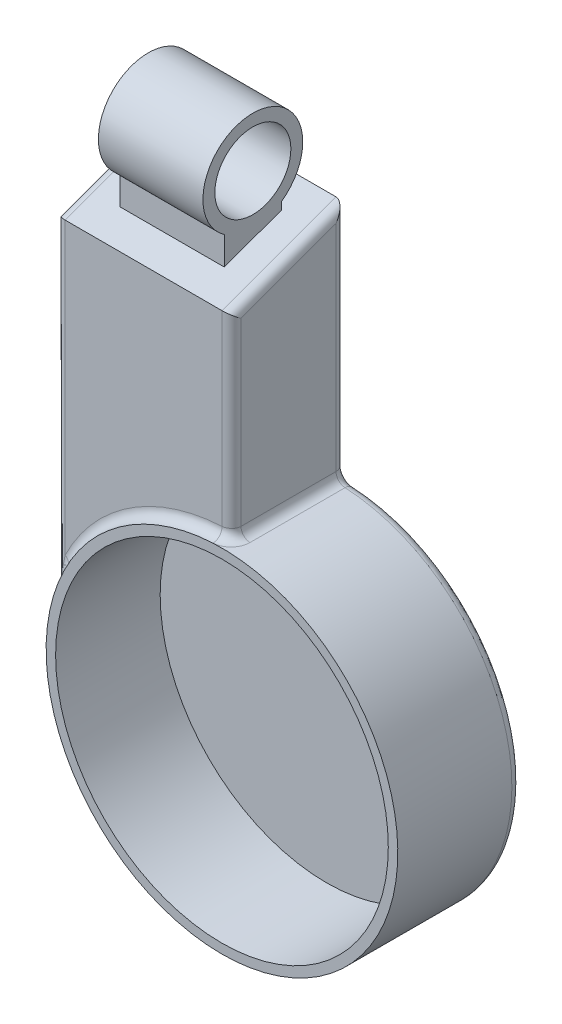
ISO-10303-21;
HEADER;
FILE_DESCRIPTION(('STEP AP214'),'2;1');
FILE_NAME('part.step','',(''),(''),'','','');
FILE_SCHEMA(('AUTOMOTIVE_DESIGN { 1 0 10303 214 1 1 1 1 }'));
ENDSEC;
DATA;
#1=APPLICATION_CONTEXT('core data for automotive mechanical design processes');
#2=APPLICATION_PROTOCOL_DEFINITION('international standard','automotive_design',2000,#1);
#3=PRODUCT_CONTEXT('',#1,'mechanical');
#4=PRODUCT('Part','Part','',(#3));
#5=PRODUCT_RELATED_PRODUCT_CATEGORY('part','',(#4));
#6=PRODUCT_DEFINITION_FORMATION('','',#4);
#7=PRODUCT_DEFINITION_CONTEXT('part definition',#1,'design');
#8=PRODUCT_DEFINITION('design','',#6,#7);
#9=PRODUCT_DEFINITION_SHAPE('','',#8);
#10=(LENGTH_UNIT() NAMED_UNIT(*) SI_UNIT(.MILLI.,.METRE.));
#11=(NAMED_UNIT(*) PLANE_ANGLE_UNIT() SI_UNIT($,.RADIAN.));
#12=(NAMED_UNIT(*) SI_UNIT($,.STERADIAN.) SOLID_ANGLE_UNIT());
#13=UNCERTAINTY_MEASURE_WITH_UNIT(LENGTH_MEASURE(1.E-05),#10,'distance_accuracy_value','');
#14=(GEOMETRIC_REPRESENTATION_CONTEXT(3) GLOBAL_UNCERTAINTY_ASSIGNED_CONTEXT((#13)) GLOBAL_UNIT_ASSIGNED_CONTEXT((#10,
#11,#12)) REPRESENTATION_CONTEXT('',''));
#15=CARTESIAN_POINT('',(0.,0.,0.));
#16=DIRECTION('',(0.,0.,1.));
#17=DIRECTION('',(1.,0.,0.));
#18=AXIS2_PLACEMENT_3D('',#15,#16,#17);
#19=CARTESIAN_POINT('',(-14.75,48.,3.));
#20=DIRECTION('',(0.,0.,1.));
#21=DIRECTION('',(1.,0.,0.));
#22=AXIS2_PLACEMENT_3D('',#19,#20,#21);
#23=PLANE('',#22);
#24=DIRECTION('',(-1.,0.,0.));
#25=VECTOR('',#24,1.);
#26=CARTESIAN_POINT('',(-3.75,43.1915780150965,3.));
#27=LINE('',#26,#25);
#28=CARTESIAN_POINT('',(-3.75,43.1915780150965,3.));
#29=VERTEX_POINT('',#28);
#30=CARTESIAN_POINT('',(-14.75,43.1915780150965,3.));
#31=VERTEX_POINT('',#30);
#32=EDGE_CURVE('E154',#29,#31,#27,.T.);
#33=ORIENTED_EDGE('',*,*,#32,.F.);
#34=DIRECTION('',(0.,-1.,0.));
#35=VECTOR('',#34,1.);
#36=CARTESIAN_POINT('',(-3.75,48.,3.));
#37=LINE('',#36,#35);
#38=CARTESIAN_POINT('',(-3.75,42.4080892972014,3.));
#39=VERTEX_POINT('',#38);
#40=EDGE_CURVE('E50',#29,#39,#37,.T.);
#41=ORIENTED_EDGE('',*,*,#40,.T.);
#42=DIRECTION('',(-1.,0.,0.));
#43=VECTOR('',#42,1.);
#44=CARTESIAN_POINT('',(18.5,42.4080892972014,3.));
#45=LINE('',#44,#43);
#46=CARTESIAN_POINT('',(-14.75,42.4080892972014,3.));
#47=VERTEX_POINT('',#46);
#48=EDGE_CURVE('E570',#39,#47,#45,.T.);
#49=ORIENTED_EDGE('',*,*,#48,.T.);
#50=DIRECTION('',(0.,-1.,0.));
#51=VECTOR('',#50,1.);
#52=CARTESIAN_POINT('',(-14.75,48.,3.));
#53=LINE('',#52,#51);
#54=EDGE_CURVE('E58',#31,#47,#53,.T.);
#55=ORIENTED_EDGE('',*,*,#54,.F.);
#56=EDGE_LOOP('',(#33,#41,#49,#55));
#57=FACE_BOUND('',#56,.T.);
#58=ADVANCED_FACE('F35',(#57),#23,.F.);
#59=CARTESIAN_POINT('',(-14.75,48.,9.));
#60=DIRECTION('',(0.,0.,-1.));
#61=DIRECTION('',(-1.,0.,0.));
#62=AXIS2_PLACEMENT_3D('',#59,#60,#61);
#63=PLANE('',#62);
#64=DIRECTION('',(-1.,0.,0.));
#65=VECTOR('',#64,1.);
#66=CARTESIAN_POINT('',(-3.75,43.1915780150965,9.));
#67=LINE('',#66,#65);
#68=CARTESIAN_POINT('',(-14.75,43.1915780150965,9.));
#69=VERTEX_POINT('',#68);
#70=CARTESIAN_POINT('',(-3.75,43.1915780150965,9.));
#71=VERTEX_POINT('',#70);
#72=EDGE_CURVE('E11',#69,#71,#67,.F.);
#73=ORIENTED_EDGE('',*,*,#72,.F.);
#74=DIRECTION('',(0.,-1.,0.));
#75=VECTOR('',#74,1.);
#76=CARTESIAN_POINT('',(-14.75,48.,9.));
#77=LINE('',#76,#75);
#78=CARTESIAN_POINT('',(-14.75,40.2242678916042,9.));
#79=VERTEX_POINT('',#78);
#80=EDGE_CURVE('E160',#69,#79,#77,.T.);
#81=ORIENTED_EDGE('',*,*,#80,.T.);
#82=DIRECTION('',(1.,0.,0.));
#83=VECTOR('',#82,1.);
#84=CARTESIAN_POINT('',(18.5,40.2242678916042,9.));
#85=LINE('',#84,#83);
#86=CARTESIAN_POINT('',(-3.75,40.2242678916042,9.));
#87=VERTEX_POINT('',#86);
#88=EDGE_CURVE('E159',#79,#87,#85,.T.);
#89=ORIENTED_EDGE('',*,*,#88,.T.);
#90=DIRECTION('',(0.,-1.,0.));
#91=VECTOR('',#90,1.);
#92=CARTESIAN_POINT('',(-3.75,48.,9.));
#93=LINE('',#92,#91);
#94=EDGE_CURVE('E152',#71,#87,#93,.T.);
#95=ORIENTED_EDGE('',*,*,#94,.F.);
#96=EDGE_LOOP('',(#73,#81,#89,#95));
#97=FACE_BOUND('',#96,.T.);
#98=ADVANCED_FACE('F157',(#97),#63,.F.);
#99=CARTESIAN_POINT('',(18.5,43.5,0.));
#100=DIRECTION('',(0.,-0.939692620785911,-0.342020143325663));
#101=DIRECTION('',(0.,0.342020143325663,-0.939692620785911));
#102=AXIS2_PLACEMENT_3D('',#99,#100,#101);
#103=PLANE('',#102);
#104=DIRECTION('',(-1.,0.,0.));
#105=VECTOR('',#104,1.);
#106=CARTESIAN_POINT('',(18.5,39.1323571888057,12.));
#107=LINE('',#106,#105);
#108=CARTESIAN_POINT('',(-1.,39.1323571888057,12.));
#109=VERTEX_POINT('',#108);
#110=CARTESIAN_POINT('',(-17.5,39.1323571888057,12.));
#111=VERTEX_POINT('',#110);
#112=EDGE_CURVE('E169',#109,#111,#107,.T.);
#113=ORIENTED_EDGE('',*,*,#112,.F.);
#114=DIRECTION('',(0.,-0.342020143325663,0.939692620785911));
#115=VECTOR('',#114,1.);
#116=CARTESIAN_POINT('',(-1.,43.5,0.));
#117=LINE('',#116,#115);
#118=CARTESIAN_POINT('',(-1.,43.5,0.));
#119=VERTEX_POINT('',#118);
#120=EDGE_CURVE('E588',#109,#119,#117,.F.);
#121=ORIENTED_EDGE('',*,*,#120,.T.);
#122=DIRECTION('',(-1.,0.,0.));
#123=VECTOR('',#122,1.);
#124=CARTESIAN_POINT('',(-18.5,43.5,0.));
#125=LINE('',#124,#123);
#126=CARTESIAN_POINT('',(-17.5,43.5,0.));
#127=VERTEX_POINT('',#126);
#128=EDGE_CURVE('E174',#119,#127,#125,.T.);
#129=ORIENTED_EDGE('',*,*,#128,.T.);
#130=DIRECTION('',(0.,-0.342020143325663,0.939692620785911));
#131=VECTOR('',#130,1.);
#132=CARTESIAN_POINT('',(-17.5,43.5,0.));
#133=LINE('',#132,#131);
#134=EDGE_CURVE('E609',#127,#111,#133,.T.);
#135=ORIENTED_EDGE('',*,*,#134,.T.);
#136=EDGE_LOOP('',(#113,#121,#129,#135));
#137=FACE_BOUND('',#136,.T.);
#138=DIRECTION('',(0.,0.342020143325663,-0.939692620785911));
#139=VECTOR('',#138,1.);
#140=CARTESIAN_POINT('',(-3.75,43.5,0.));
#141=LINE('',#140,#139);
#142=EDGE_CURVE('E43',#87,#39,#141,.T.);
#143=ORIENTED_EDGE('',*,*,#142,.F.);
#144=ORIENTED_EDGE('',*,*,#88,.F.);
#145=DIRECTION('',(0.,-0.342020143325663,0.939692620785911));
#146=VECTOR('',#145,1.);
#147=CARTESIAN_POINT('',(-14.75,43.5,0.));
#148=LINE('',#147,#146);
#149=EDGE_CURVE('E568',#47,#79,#148,.T.);
#150=ORIENTED_EDGE('',*,*,#149,.F.);
#151=ORIENTED_EDGE('',*,*,#48,.F.);
#152=EDGE_LOOP('',(#143,#144,#150,#151));
#153=FACE_BOUND('',#152,.T.);
#154=ADVANCED_FACE('F208',(#137,#153),#103,.F.);
#155=CARTESIAN_POINT('',(0.,0.,13.));
#156=DIRECTION('',(0.,0.,-1.));
#157=DIRECTION('',(-1.,0.,0.));
#158=AXIS2_PLACEMENT_3D('',#155,#156,#157);
#159=CYLINDRICAL_SURFACE('',#158,18.5);
#160=CARTESIAN_POINT('',(0.,0.,13.));
#161=DIRECTION('',(0.,0.,1.));
#162=DIRECTION('',(1.,0.,0.));
#163=AXIS2_PLACEMENT_3D('',#160,#161,#162);
#164=CIRCLE('',#163,18.5);
#165=CARTESIAN_POINT('',(-16.602564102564,8.16118038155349,13.));
#166=VERTEX_POINT('',#165);
#167=CARTESIAN_POINT('',(-0.948717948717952,18.475657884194,13.));
#168=VERTEX_POINT('',#167);
#169=EDGE_CURVE('E177',#166,#168,#164,.T.);
#170=ORIENTED_EDGE('',*,*,#169,.F.);
#171=CARTESIAN_POINT('',(-15.6779646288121,9.82096864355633,12.746481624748));
#172=CARTESIAN_POINT('',(-15.9118922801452,9.44753201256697,11.2589580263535));
#173=CARTESIAN_POINT('',(-17.0127110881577,10.3518318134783,11.873240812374));
#174=CARTESIAN_POINT('',(-15.7190255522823,9.75542321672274,12.7706205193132));
#175=CARTESIAN_POINT('',(-15.9322694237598,9.41158945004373,11.3056108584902));
#176=CARTESIAN_POINT('',(-17.0343513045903,10.2827433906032,11.8853102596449));
#177=CARTESIAN_POINT('',(-15.7599766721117,9.68913260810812,12.7926121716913));
#178=CARTESIAN_POINT('',(-15.9549811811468,9.37175366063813,11.3508656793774));
#179=CARTESIAN_POINT('',(-17.0559336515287,10.2128695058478,11.8963060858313));
#180=CARTESIAN_POINT('',(-15.841479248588,9.55529473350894,12.8326729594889));
#181=CARTESIAN_POINT('',(-16.0035852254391,9.28633553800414,11.4368688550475));
#182=CARTESIAN_POINT('',(-17.0988877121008,10.0717971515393,11.9163364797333));
#183=CARTESIAN_POINT('',(-15.8820308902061,9.48774809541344,12.8507440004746));
#184=CARTESIAN_POINT('',(-16.0294128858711,9.24087101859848,11.4777763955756));
#185=CARTESIAN_POINT('',(-17.1202595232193,10.0005993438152,11.925372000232));
#186=CARTESIAN_POINT('',(-16.0026712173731,9.2838247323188,12.8995822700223));
#187=CARTESIAN_POINT('',(-16.1092280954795,9.09939203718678,11.5921727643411));
#188=CARTESIAN_POINT('',(-17.183840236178,9.78565309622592,11.9497911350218));
#189=CARTESIAN_POINT('',(-16.0819562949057,9.14582828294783,12.9250937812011));
#190=CARTESIAN_POINT('',(-16.1674772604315,8.99496891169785,11.6612874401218));
#191=CARTESIAN_POINT('',(-17.2256256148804,9.64019737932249,11.9625468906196));
#192=CARTESIAN_POINT('',(-16.2367626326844,8.86806659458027,12.9642558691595));
#193=CARTESIAN_POINT('',(-16.2877410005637,8.77414273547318,11.7822838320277));
#194=CARTESIAN_POINT('',(-17.3072127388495,9.34742154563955,11.9821279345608));
#195=CARTESIAN_POINT('',(-16.3123123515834,8.72833033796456,12.9780161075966));
#196=CARTESIAN_POINT('',(-16.3496983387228,8.65809995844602,11.8351668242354));
#197=CARTESIAN_POINT('',(-17.3470294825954,9.20013197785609,11.9890080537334));
#198=CARTESIAN_POINT('',(-16.460048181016,8.44642978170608,12.9958884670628));
#199=CARTESIAN_POINT('',(-16.4749568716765,8.41691412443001,11.9267989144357));
#200=CARTESIAN_POINT('',(-17.4248902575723,8.90299355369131,11.9979442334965));
#201=CARTESIAN_POINT('',(-16.53223143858,8.30426355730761,12.9999925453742));
#202=CARTESIAN_POINT('',(-16.5383868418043,8.29175575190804,11.9661822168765));
#203=CARTESIAN_POINT('',(-17.4629327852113,8.75314266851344,11.9999962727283));
#204=CARTESIAN_POINT('',(-16.7331292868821,7.89556153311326,13.0000138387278));
#205=CARTESIAN_POINT('',(-16.7162114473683,7.92995293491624,12.0598857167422));
#206=CARTESIAN_POINT('',(-17.5688113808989,8.32234864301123,12.0000069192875));
#207=CARTESIAN_POINT('',(-16.8573169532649,7.6267826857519,12.9859098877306));
#208=CARTESIAN_POINT('',(-16.8332652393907,7.67955090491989,12.1028410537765));
#209=CARTESIAN_POINT('',(-17.6342616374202,8.03904120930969,11.9929549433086));
#210=CARTESIAN_POINT('',(-17.0920531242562,7.08512648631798,12.9364114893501));
#211=CARTESIAN_POINT('',(-17.0580254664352,7.16625117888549,12.1560976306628));
#212=CARTESIAN_POINT('',(-17.7579739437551,7.46810629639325,11.9682057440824));
#213=CARTESIAN_POINT('',(-17.2025950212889,6.81224721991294,12.9010067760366));
#214=CARTESIAN_POINT('',(-17.1669583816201,6.9021259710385,12.16810471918));
#215=CARTESIAN_POINT('',(-17.8162325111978,7.18047679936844,11.9505033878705));
#216=CARTESIAN_POINT('',(-17.4105593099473,6.2617556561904,12.8134705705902));
#217=CARTESIAN_POINT('',(-17.3733298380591,6.36461315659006,12.1676857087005));
#218=CARTESIAN_POINT('',(-17.9258353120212,6.60022893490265,11.9067352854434));
#219=CARTESIAN_POINT('',(-17.5078850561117,5.98412363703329,12.7612243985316));
#220=CARTESIAN_POINT('',(-17.4718104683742,6.08975366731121,12.1560325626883));
#221=CARTESIAN_POINT('',(-17.9771286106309,6.30758977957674,11.8806121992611));
#222=CARTESIAN_POINT('',(-17.6885463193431,5.42688939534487,12.6438374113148));
#223=CARTESIAN_POINT('',(-17.6551120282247,5.53547719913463,12.1140405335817));
#224=CARTESIAN_POINT('',(-18.0723419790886,5.7202347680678,11.8219187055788));
#225=CARTESIAN_POINT('',(-17.771884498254,5.14728755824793,12.5786990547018));
#226=CARTESIAN_POINT('',(-17.7408483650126,5.25472075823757,12.0841714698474));
#227=CARTESIAN_POINT('',(-18.1162634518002,5.42551931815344,11.7893495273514));
#228=CARTESIAN_POINT('',(-17.9284974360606,4.57294540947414,12.4350081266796));
#229=CARTESIAN_POINT('',(-17.9019027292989,4.67699795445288,12.008582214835));
#230=CARTESIAN_POINT('',(-18.1988027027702,4.82013164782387,11.7175040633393));
#231=CARTESIAN_POINT('',(-18.0010849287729,4.27813066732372,12.3559569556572));
#232=CARTESIAN_POINT('',(-17.9774369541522,4.37807963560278,11.9623051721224));
#233=CARTESIAN_POINT('',(-18.2370582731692,4.50938097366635,11.6779784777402));
#234=CARTESIAN_POINT('',(-18.1313256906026,3.68735129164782,12.1895496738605));
#235=CARTESIAN_POINT('',(-18.1127935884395,3.77858654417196,11.858352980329));
#236=CARTESIAN_POINT('',(-18.3056986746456,3.88666757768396,11.5947748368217));
#237=CARTESIAN_POINT('',(-18.1889775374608,3.39138655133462,12.1021927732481));
#238=CARTESIAN_POINT('',(-18.1732629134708,3.47658418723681,11.8006544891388));
#239=CARTESIAN_POINT('',(-18.3360827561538,3.57470474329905,11.5510963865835));
#240=CARTESIAN_POINT('',(-18.3395641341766,2.50394295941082,11.8315768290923));
#241=CARTESIAN_POINT('',(-18.3294403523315,2.57804759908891,11.6171096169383));
#242=CARTESIAN_POINT('',(-18.4154459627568,2.63929122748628,11.4157884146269));
#243=CARTESIAN_POINT('',(-18.4106379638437,1.91103625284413,11.6392734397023));
#244=CARTESIAN_POINT('',(-18.4055479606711,1.96534498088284,11.4767463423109));
#245=CARTESIAN_POINT('',(-18.4529037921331,2.01433550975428,11.3196367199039));
#246=CARTESIAN_POINT('',(-18.4683806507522,1.10251039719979,11.3709047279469));
#247=CARTESIAN_POINT('',(-18.4666714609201,1.1325491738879,11.277528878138));
#248=CARTESIAN_POINT('',(-18.4833357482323,1.1621055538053,11.1854523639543));
#249=CARTESIAN_POINT('',(-18.4799764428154,0.887109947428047,11.298815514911));
#250=CARTESIAN_POINT('',(-18.4788959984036,0.911209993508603,11.223779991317));
#251=CARTESIAN_POINT('',(-18.4894470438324,0.935061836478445,11.149407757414));
#252=CARTESIAN_POINT('',(-18.4956302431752,0.456210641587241,11.1539911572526));
#253=CARTESIAN_POINT('',(-18.4953775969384,0.468791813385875,11.1155460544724));
#254=CARTESIAN_POINT('',(-18.4976970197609,0.480870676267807,11.0769955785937));
#255=CARTESIAN_POINT('',(-18.4996888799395,0.240711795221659,11.0812560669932));
#256=CARTESIAN_POINT('',(-18.499671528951,0.247226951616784,11.0609440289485));
#257=CARTESIAN_POINT('',(-18.4998360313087,0.253723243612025,11.0406280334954));
#258=CARTESIAN_POINT('',(-18.4999942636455,0.0168224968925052,11.0056787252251));
#259=CARTESIAN_POINT('',(-18.4999939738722,0.0172771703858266,11.004259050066));
#260=CARTESIAN_POINT('',(-18.4999969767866,0.0177318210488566,11.0028393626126));
#261=CARTESIAN_POINT('',(-18.5000000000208,0.00841123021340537,11.0028393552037));
#262=CARTESIAN_POINT('',(-18.5000000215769,0.00863855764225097,11.0021295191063));
#263=CARTESIAN_POINT('',(-18.5000000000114,0.00886589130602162,11.0014196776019));
#264=CARTESIAN_POINT('',(-18.5,0.,11.));
#265=CARTESIAN_POINT('',(-18.5,0.,11.));
#266=CARTESIAN_POINT('',(-18.5,0.,11.));
#267=(BOUNDED_SURFACE() B_SPLINE_SURFACE(3,2,((#171,#172,#173),(#174,#175,#176),(#177,#178,
#179),(#180,#181,#182),(#183,#184,#185),(#186,#187,#188),(#189,#190,#191),(#192,#193,#194),
(#195,#196,#197),(#198,#199,#200),(#201,#202,#203),(#204,#205,#206),(#207,#208,#209),(#210,#211,
#212),(#213,#214,#215),(#216,#217,#218),(#219,#220,#221),(#222,#223,#224),(#225,#226,#227),
(#228,#229,#230),(#231,#232,#233),(#234,#235,#236),(#237,#238,#239),(#240,#241,#242),(#243,#244,
#245),(#246,#247,#248),(#249,#250,#251),(#252,#253,#254),(#255,#256,#257),(#258,#259,#260),
(#261,#262,#263),(#264,#265,#266)),.UNSPECIFIED.,.F.,.F.,.F.) B_SPLINE_SURFACE_WITH_KNOTS((4,2,
2,2,2,2,2,2,2,2,2,2,2,2,2,4),(3,3),(0.,0.254993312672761,0.509862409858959,1.01830042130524,
1.52194021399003,2.02599934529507,2.96173204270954,3.89791607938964,4.8406146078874,
5.78313353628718,6.77152852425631,7.76001759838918,9.73069120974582,10.4462140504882,
11.1616772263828,11.1896057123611),(0.,1.),
.UNSPECIFIED.) GEOMETRIC_REPRESENTATION_ITEM() RATIONAL_B_SPLINE_SURFACE(((1.,0.54177639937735,
1.),(1.,0.549739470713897,1.),(1.,0.557572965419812,1.),(1.,0.572974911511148,1.),(1.,
0.580543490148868,1.),(1.,0.602816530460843,1.),(1.,0.617128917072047,1.),(1.,0.644593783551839,
1.),(1.,0.657755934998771,1.),(1.,0.683131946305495,1.),(1.,0.695345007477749,1.),(1.,
0.72894127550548,1.),(1.,0.749220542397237,1.),(1.,0.786974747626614,1.),(1.,0.804448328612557,
1.),(1.,0.836952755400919,1.),(1.,0.851965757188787,1.),(1.,0.879598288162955,1.),(1.,
0.892218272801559,1.),(1.,0.915784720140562,1.),(1.,0.926619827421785,1.),(1.,0.945967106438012,
1.),(1.,0.954479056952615,1.),(1.,0.976643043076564,1.),(1.,0.98699866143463,1.),(1.,
0.995403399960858,1.),(1.,0.997089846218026,1.),(1.,0.999365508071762,1.),(1.,0.999954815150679,
1.),(1.,0.999999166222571,1.),(1.,0.999999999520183,1.),(1.,1.,1.))) REPRESENTATION_ITEM('') SURFACE());
#268=CARTESIAN_POINT('',(-15.6779646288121,9.82096864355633,12.746481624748));
#269=CARTESIAN_POINT('',(-15.7190255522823,9.75542321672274,12.7706205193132));
#270=CARTESIAN_POINT('',(-15.7599766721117,9.68913260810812,12.7926121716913));
#271=CARTESIAN_POINT('',(-15.841479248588,9.55529473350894,12.8326729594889));
#272=CARTESIAN_POINT('',(-15.8820308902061,9.48774809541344,12.8507440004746));
#273=CARTESIAN_POINT('',(-16.0026712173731,9.2838247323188,12.8995822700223));
#274=CARTESIAN_POINT('',(-16.0819562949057,9.14582828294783,12.9250937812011));
#275=CARTESIAN_POINT('',(-16.2367626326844,8.86806659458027,12.9642558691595));
#276=CARTESIAN_POINT('',(-16.3123123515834,8.72833033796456,12.9780161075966));
#277=CARTESIAN_POINT('',(-16.460048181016,8.44642978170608,12.9958884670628));
#278=CARTESIAN_POINT('',(-16.53223143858,8.30426355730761,12.9999925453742));
#279=CARTESIAN_POINT('',(-16.7331292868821,7.89556153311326,13.0000138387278));
#280=CARTESIAN_POINT('',(-16.8573169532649,7.6267826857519,12.9859098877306));
#281=CARTESIAN_POINT('',(-17.0920531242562,7.08512648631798,12.9364114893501));
#282=CARTESIAN_POINT('',(-17.2025950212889,6.81224721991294,12.9010067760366));
#283=CARTESIAN_POINT('',(-17.4105593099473,6.2617556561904,12.8134705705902));
#284=CARTESIAN_POINT('',(-17.5078850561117,5.98412363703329,12.7612243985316));
#285=CARTESIAN_POINT('',(-17.6885463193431,5.42688939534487,12.6438374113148));
#286=CARTESIAN_POINT('',(-17.771884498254,5.14728755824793,12.5786990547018));
#287=CARTESIAN_POINT('',(-17.9284974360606,4.57294540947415,12.4350081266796));
#288=CARTESIAN_POINT('',(-18.0010849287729,4.27813066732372,12.3559569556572));
#289=CARTESIAN_POINT('',(-18.1313256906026,3.68735129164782,12.1895496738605));
#290=CARTESIAN_POINT('',(-18.1889775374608,3.39138655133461,12.1021927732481));
#291=CARTESIAN_POINT('',(-18.3395641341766,2.50394295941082,11.8315768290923));
#292=CARTESIAN_POINT('',(-18.4106379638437,1.91103625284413,11.6392734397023));
#293=CARTESIAN_POINT('',(-18.4683806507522,1.10251039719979,11.3709047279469));
#294=CARTESIAN_POINT('',(-18.4799764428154,0.887109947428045,11.298815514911));
#295=CARTESIAN_POINT('',(-18.4956302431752,0.456210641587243,11.1539911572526));
#296=CARTESIAN_POINT('',(-18.4996888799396,0.240711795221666,11.0812560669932));
#297=CARTESIAN_POINT('',(-18.4999942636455,0.0168224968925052,11.0056787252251));
#298=CARTESIAN_POINT('',(-18.5000000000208,0.00841123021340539,11.0028393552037));
#299=CARTESIAN_POINT('',(-18.5,0.,11.));
#300=B_SPLINE_CURVE_WITH_KNOTS('',3,(#268,#269,#270,#271,#272,#273,#274,#275,#276,#277,#278,
#279,#280,#281,#282,#283,#284,#285,#286,#287,#288,#289,#290,#291,#292,#293,#294,#295,#296,#297,
#298,#299),.UNSPECIFIED.,.F.,.F.,(4,2,2,2,2,2,2,2,2,2,2,2,2,2,2,4),(0.,0.254993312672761,
0.509862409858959,1.01830042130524,1.52194021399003,2.02599934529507,2.96173204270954,
3.89791607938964,4.8406146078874,5.78313353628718,6.77152852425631,7.76001759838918,
9.73069120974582,10.4462140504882,11.1616772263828,11.1896057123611),.UNSPECIFIED.);
#301=CARTESIAN_POINT('',(-18.5,0.,11.));
#302=VERTEX_POINT('',#301);
#303=EDGE_CURVE('E324',#166,#302,#300,.T.);
#304=ORIENTED_EDGE('',*,*,#303,.T.);
#305=DIRECTION('',(0.,0.,1.));
#306=VECTOR('',#305,1.);
#307=CARTESIAN_POINT('',(-18.5,0.,0.));
#308=LINE('',#307,#306);
#309=CARTESIAN_POINT('',(-18.5,0.,1.));
#310=VERTEX_POINT('',#309);
#311=EDGE_CURVE('E172',#310,#302,#308,.T.);
#312=ORIENTED_EDGE('',*,*,#311,.F.);
#313=CARTESIAN_POINT('',(0.,0.,0.999999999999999));
#314=DIRECTION('',(0.,0.,1.));
#315=DIRECTION('',(1.,0.,0.));
#316=AXIS2_PLACEMENT_3D('',#313,#314,#315);
#317=CIRCLE('',#316,18.5);
#318=CARTESIAN_POINT('',(0.948717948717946,18.475657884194,0.999999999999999));
#319=VERTEX_POINT('',#318);
#320=EDGE_CURVE('E620',#310,#319,#317,.T.);
#321=ORIENTED_EDGE('',*,*,#320,.T.);
#322=DIRECTION('',(0.,0.,-1.));
#323=VECTOR('',#322,1.);
#324=CARTESIAN_POINT('',(0.948717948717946,18.475657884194,13.));
#325=LINE('',#324,#323);
#326=CARTESIAN_POINT('',(0.948717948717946,18.475657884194,11.));
#327=VERTEX_POINT('',#326);
#328=EDGE_CURVE('E198',#319,#327,#325,.F.);
#329=ORIENTED_EDGE('',*,*,#328,.T.);
#330=CARTESIAN_POINT('',(0.84199509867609,18.4808291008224,10.3387041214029));
#331=CARTESIAN_POINT('',(-0.0610167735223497,18.5219707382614,10.6557345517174));
#332=CARTESIAN_POINT('',(-0.0562458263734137,19.479792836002,10.6693520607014));
#333=CARTESIAN_POINT('',(0.877333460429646,18.4791925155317,10.4447310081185));
#334=CARTESIAN_POINT('',(-0.0409950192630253,18.522785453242,10.7100060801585));
#335=CARTESIAN_POINT('',(-0.0376215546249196,19.4780677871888,10.7223655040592));
#336=CARTESIAN_POINT('',(0.904017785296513,18.477900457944,10.5539311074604));
#337=CARTESIAN_POINT('',(-0.0257353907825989,18.5233867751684,10.766686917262));
#338=CARTESIAN_POINT('',(-0.02355819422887,19.4767058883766,10.7769655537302));
#339=CARTESIAN_POINT('',(0.939700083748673,18.4761345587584,10.775421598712));
#340=CARTESIAN_POINT('',(-0.00525954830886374,18.5241805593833,10.8822102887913));
#341=CARTESIAN_POINT('',(-0.00475265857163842,19.4748445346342,10.887710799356));
#342=CARTESIAN_POINT('',(0.948711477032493,18.4756600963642,10.8877095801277));
#343=CARTESIAN_POINT('',(-9.18741426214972E-06,18.524374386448,10.9411218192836));
#344=CARTESIAN_POINT('',(-3.41076663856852E-06,19.4743444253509,10.9438547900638));
#345=CARTESIAN_POINT('',(0.948724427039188,18.4756556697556,11.1124055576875));
#346=CARTESIAN_POINT('',(9.19681343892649E-06,18.5243739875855,11.0589384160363));
#347=CARTESIAN_POINT('',(3.41426388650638E-06,19.4743397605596,11.0562027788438));
#348=CARTESIAN_POINT('',(0.939707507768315,18.4761266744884,11.2248135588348));
#349=CARTESIAN_POINT('',(-0.00523350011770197,18.5241793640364,11.1179265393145));
#350=CARTESIAN_POINT('',(-0.00474874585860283,19.4748362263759,11.1124067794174));
#351=CARTESIAN_POINT('',(0.903917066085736,18.4779130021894,11.4464115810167));
#352=CARTESIAN_POINT('',(-0.0258152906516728,18.5233859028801,11.2334782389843));
#353=CARTESIAN_POINT('',(-0.0236112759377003,19.4767191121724,11.2232057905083));
#354=CARTESIAN_POINT('',(0.877146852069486,18.4792281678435,11.5556021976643));
#355=CARTESIAN_POINT('',(-0.0411797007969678,18.5227860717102,11.2901146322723));
#356=CARTESIAN_POINT('',(-0.0377199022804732,19.4781053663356,11.2778010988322));
#357=CARTESIAN_POINT('',(0.806608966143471,18.4824407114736,11.7676944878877));
#358=CARTESIAN_POINT('',(-0.081036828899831,18.5211478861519,11.3989158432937));
#359=CARTESIAN_POINT('',(-0.074895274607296,19.4814915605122,11.3838472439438));
#360=CARTESIAN_POINT('',(0.762841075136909,18.4843380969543,11.8705960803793));
#361=CARTESIAN_POINT('',(-0.105573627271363,18.5201075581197,11.4511258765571));
#362=CARTESIAN_POINT('',(-0.0979621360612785,19.4834915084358,11.4352980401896));
#363=CARTESIAN_POINT('',(0.659547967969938,18.4883113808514,12.0672054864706));
#364=CARTESIAN_POINT('',(-0.162342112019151,18.5175623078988,11.5494653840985));
#365=CARTESIAN_POINT('',(-0.152400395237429,19.4876795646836,11.5336027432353));
#366=CARTESIAN_POINT('',(0.600021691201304,18.4903872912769,12.1609126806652));
#367=CARTESIAN_POINT('',(-0.194617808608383,18.5160549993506,11.5956040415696));
#368=CARTESIAN_POINT('',(-0.183772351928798,19.489867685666,11.5804563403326));
#369=CARTESIAN_POINT('',(0.466839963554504,18.4942285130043,12.3365486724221));
#370=CARTESIAN_POINT('',(-0.265235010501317,18.5125902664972,11.6807918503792));
#371=CARTESIAN_POINT('',(-0.253962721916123,19.4939165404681,11.6682743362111));
#372=CARTESIAN_POINT('',(0.393173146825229,18.4959935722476,12.4184679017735));
#373=CARTESIAN_POINT('',(-0.30360657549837,18.5106306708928,11.7198114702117));
#374=CARTESIAN_POINT('',(-0.29278712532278,19.4957770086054,11.7092339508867));
#375=CARTESIAN_POINT('',(0.233826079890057,18.4986935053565,12.5681118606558));
#376=CARTESIAN_POINT('',(-0.384774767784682,18.5063399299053,11.7902488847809));
#377=CARTESIAN_POINT('',(-0.376767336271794,19.4986228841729,11.7840559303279));
#378=CARTESIAN_POINT('',(0.148145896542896,18.499628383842,12.6358366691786));
#379=CARTESIAN_POINT('',(-0.427565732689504,18.5040085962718,11.821621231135));
#380=CARTESIAN_POINT('',(-0.421923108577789,19.499608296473,11.8179183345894));
#381=CARTESIAN_POINT('',(-0.0326988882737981,18.5001915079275,12.7550986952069));
#382=CARTESIAN_POINT('',(-0.51618906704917,18.4991091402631,11.8767232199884));
#383=CARTESIAN_POINT('',(-0.517233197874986,19.5002018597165,11.8775493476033));
#384=CARTESIAN_POINT('',(-0.127853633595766,18.4998210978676,12.8066525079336));
#385=CARTESIAN_POINT('',(-0.561977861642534,18.4965433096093,11.9004094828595));
#386=CARTESIAN_POINT('',(-0.56738232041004,19.4998114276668,11.9033262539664));
#387=CARTESIAN_POINT('',(-0.324995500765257,18.4974075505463,12.8921943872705));
#388=CARTESIAN_POINT('',(-0.655722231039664,18.4913206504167,11.9403850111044));
#389=CARTESIAN_POINT('',(-0.671281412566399,19.4972674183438,11.9460971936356));
#390=CARTESIAN_POINT('',(-0.42698205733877,18.4953645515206,12.9261839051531));
#391=CARTESIAN_POINT('',(-0.703606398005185,18.4886678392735,11.9566328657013));
#392=CARTESIAN_POINT('',(-0.725031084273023,19.4951139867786,11.963091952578));
#393=CARTESIAN_POINT('',(-0.634533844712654,18.4894050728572,12.9755662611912));
#394=CARTESIAN_POINT('',(-0.800882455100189,18.4833882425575,11.9818307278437));
#395=CARTESIAN_POINT('',(-0.834416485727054,19.4888323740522,11.9877831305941));
#396=CARTESIAN_POINT('',(-0.740086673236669,18.4854945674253,12.9910178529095));
#397=CARTESIAN_POINT('',(-0.850177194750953,18.4807663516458,11.990782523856));
#398=CARTESIAN_POINT('',(-0.890045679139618,19.4847104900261,11.9955089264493));
#399=CARTESIAN_POINT('',(-0.952101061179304,18.4757892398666,13.0031273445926));
#400=CARTESIAN_POINT('',(-0.950110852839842,18.4755690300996,12.0013260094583));
#401=CARTESIAN_POINT('',(-1.0017829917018,19.4744805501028,12.0015636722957));
#402=CARTESIAN_POINT('',(-1.05856285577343,18.4699939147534,12.9997802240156));
#403=CARTESIAN_POINT('',(-1.00064975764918,18.4729985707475,12.0029219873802));
#404=CARTESIAN_POINT('',(-1.05789123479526,19.4683719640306,11.999890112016));
#405=CARTESIAN_POINT('',(-1.2693659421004,18.4567003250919,12.9743988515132));
#406=CARTESIAN_POINT('',(-1.10268737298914,18.4678517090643,11.9982591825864));
#407=CARTESIAN_POINT('',(-1.16899015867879,19.4543598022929,11.9871994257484));
#408=CARTESIAN_POINT('',(-1.37370683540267,18.4492017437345,12.9523611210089));
#409=CARTESIAN_POINT('',(-1.15409084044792,18.4652799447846,11.9920352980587));
#410=CARTESIAN_POINT('',(-1.22398062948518,19.4464558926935,11.9761805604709));
#411=CARTESIAN_POINT('',(-1.57742756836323,18.4329186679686,12.8903521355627));
#412=CARTESIAN_POINT('',(-1.25691257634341,18.4600507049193,11.971010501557));
#413=CARTESIAN_POINT('',(-1.33134696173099,19.429292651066,11.9451760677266));
#414=CARTESIAN_POINT('',(-1.67680483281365,18.424133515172,12.8503716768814));
#415=CARTESIAN_POINT('',(-1.30825988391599,18.4573972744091,11.9562681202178));
#416=CARTESIAN_POINT('',(-1.38372146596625,19.420032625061,11.92518583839));
#417=CARTESIAN_POINT('',(-1.77223441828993,18.4149174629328,12.8018108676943));
#418=CARTESIAN_POINT('',(-1.3593677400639,18.4546513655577,11.9368673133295));
#419=CARTESIAN_POINT('',(-1.43401543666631,19.4103184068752,11.9009054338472));
#420=(BOUNDED_SURFACE() B_SPLINE_SURFACE(3,2,((#330,#331,#332),(#333,#334,#335),(#336,#337,
#338),(#339,#340,#341),(#342,#343,#344),(#345,#346,#347),(#348,#349,#350),(#351,#352,#353),
(#354,#355,#356),(#357,#358,#359),(#360,#361,#362),(#363,#364,#365),(#366,#367,#368),(#369,#370,
#371),(#372,#373,#374),(#375,#376,#377),(#378,#379,#380),(#381,#382,#383),(#384,#385,#386),
(#387,#388,#389),(#390,#391,#392),(#393,#394,#395),(#396,#397,#398),(#399,#400,#401),(#402,#403,
#404),(#405,#406,#407),(#408,#409,#410),(#411,#412,#413),(#414,#415,#416),(#417,#418,#419)),
.UNSPECIFIED.,.F.,.F.,.F.) B_SPLINE_SURFACE_WITH_KNOTS((4,2,2,2,2,2,2,2,2,2,2,2,2,2,4),(3,3),
(0.,0.336732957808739,0.673210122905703,1.01003229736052,1.3467917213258,1.68355548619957,
2.02034192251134,2.35740020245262,2.69445660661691,3.03116597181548,3.36784751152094,
3.70345913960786,4.03916040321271,4.37492415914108,4.71086034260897),(0.,1.),
.UNSPECIFIED.) GEOMETRIC_REPRESENTATION_ITEM() RATIONAL_B_SPLINE_SURFACE(((1.,0.722133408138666,
1.),(1.,0.723060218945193,1.),(1.,0.723779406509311,1.),(1.,0.724754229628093,1.),(1.,
0.725010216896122,1.),(1.,0.72501188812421,1.),(1.,0.724757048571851,1.),(1.,0.723774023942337,
1.),(1.,0.723045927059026,1.),(1.,0.721214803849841,1.),(1.,0.720111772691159,1.),(1.,
0.717685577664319,1.),(1.,0.716362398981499,1.),(1.,0.713688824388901,1.),(1.,0.712338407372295,
1.),(1.,0.709823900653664,1.),(1.,0.708659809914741,1.),(1.,0.706723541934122,1.),(1.,
0.705950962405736,1.),(1.,0.704964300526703,1.),(1.,0.704750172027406,1.),(1.,0.704987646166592,
1.),(1.,0.705437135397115,1.),(1.,0.707026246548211,1.),(1.,0.708166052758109,1.),(1.,
0.711085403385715,1.),(1.,0.712865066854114,1.),(1.,0.716922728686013,1.),(1.,0.719200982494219,
1.),(1.,0.721656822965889,1.))) REPRESENTATION_ITEM('') SURFACE());
#421=CARTESIAN_POINT('',(-1.77223441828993,18.4149174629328,12.8018108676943));
#422=CARTESIAN_POINT('',(-1.67680483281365,18.424133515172,12.8503716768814));
#423=CARTESIAN_POINT('',(-1.57742756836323,18.4329186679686,12.8903521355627));
#424=CARTESIAN_POINT('',(-1.37370683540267,18.4492017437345,12.9523611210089));
#425=CARTESIAN_POINT('',(-1.2693659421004,18.4567003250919,12.9743988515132));
#426=CARTESIAN_POINT('',(-1.05856285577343,18.4699939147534,12.9997802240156));
#427=CARTESIAN_POINT('',(-0.952101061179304,18.4757892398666,13.0031273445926));
#428=CARTESIAN_POINT('',(-0.740086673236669,18.4854945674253,12.9910178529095));
#429=CARTESIAN_POINT('',(-0.634533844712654,18.4894050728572,12.9755662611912));
#430=CARTESIAN_POINT('',(-0.42698205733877,18.4953645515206,12.9261839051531));
#431=CARTESIAN_POINT('',(-0.324995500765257,18.4974075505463,12.8921943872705));
#432=CARTESIAN_POINT('',(-0.127853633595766,18.4998210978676,12.8066525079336));
#433=CARTESIAN_POINT('',(-0.0326988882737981,18.5001915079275,12.7550986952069));
#434=CARTESIAN_POINT('',(0.148145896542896,18.499628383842,12.6358366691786));
#435=CARTESIAN_POINT('',(0.233826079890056,18.4986935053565,12.5681118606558));
#436=CARTESIAN_POINT('',(0.393173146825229,18.4959935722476,12.4184679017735));
#437=CARTESIAN_POINT('',(0.466839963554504,18.4942285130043,12.3365486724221));
#438=CARTESIAN_POINT('',(0.600021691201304,18.4903872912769,12.1609126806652));
#439=CARTESIAN_POINT('',(0.659547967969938,18.4883113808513,12.0672054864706));
#440=CARTESIAN_POINT('',(0.762841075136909,18.4843380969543,11.8705960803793));
#441=CARTESIAN_POINT('',(0.806608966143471,18.4824407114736,11.7676944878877));
#442=CARTESIAN_POINT('',(0.877146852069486,18.4792281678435,11.5556021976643));
#443=CARTESIAN_POINT('',(0.903917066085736,18.4779130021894,11.4464115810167));
#444=CARTESIAN_POINT('',(0.939707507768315,18.4761266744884,11.2248135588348));
#445=CARTESIAN_POINT('',(0.948724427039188,18.4756556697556,11.1124055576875));
#446=CARTESIAN_POINT('',(0.948711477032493,18.4756600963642,10.8877095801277));
#447=CARTESIAN_POINT('',(0.939700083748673,18.4761345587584,10.775421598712));
#448=CARTESIAN_POINT('',(0.904017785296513,18.477900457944,10.5539311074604));
#449=CARTESIAN_POINT('',(0.877333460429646,18.4791925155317,10.4447310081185));
#450=CARTESIAN_POINT('',(0.84199509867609,18.4808291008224,10.3387041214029));
#451=B_SPLINE_CURVE_WITH_KNOTS('',3,(#421,#422,#423,#424,#425,#426,#427,#428,#429,#430,#431,
#432,#433,#434,#435,#436,#437,#438,#439,#440,#441,#442,#443,#444,#445,#446,#447,#448,#449,#450),
.UNSPECIFIED.,.F.,.F.,(4,2,2,2,2,2,2,2,2,2,2,2,2,2,4),(0.,0.335936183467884,0.671699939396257,
1.00740120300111,1.34301283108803,1.67969437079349,2.01640373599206,2.35346014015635,
2.69051842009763,3.0273048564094,3.36406862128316,3.70082804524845,4.03765021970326,
4.37412738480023,4.71086034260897),.UNSPECIFIED.);
#452=EDGE_CURVE('E190',#168,#327,#451,.T.);
#453=ORIENTED_EDGE('',*,*,#452,.F.);
#454=EDGE_LOOP('',(#170,#304,#312,#321,#329,#453));
#455=FACE_BOUND('',#454,.T.);
#456=ADVANCED_FACE('F203',(#455),#159,.T.);
#457=CARTESIAN_POINT('',(0.,0.,13.));
#458=DIRECTION('',(0.,0.,1.));
#459=DIRECTION('',(1.,0.,0.));
#460=AXIS2_PLACEMENT_3D('',#457,#458,#459);
#461=PLANE('',#460);
#462=CARTESIAN_POINT('',(0.,0.,13.));
#463=DIRECTION('',(0.,0.,1.));
#464=DIRECTION('',(1.,0.,0.));
#465=AXIS2_PLACEMENT_3D('',#462,#463,#464);
#466=CIRCLE('',#465,17.5);
#467=CARTESIAN_POINT('',(17.5,0.,13.));
#468=VERTEX_POINT('',#467);
#469=EDGE_CURVE('E314',#468,#468,#466,.T.);
#470=ORIENTED_EDGE('',*,*,#469,.F.);
#471=EDGE_LOOP('',(#470));
#472=FACE_BOUND('',#471,.T.);
#473=EDGE_CURVE('E180',#168,#166,#164,.T.);
#474=ORIENTED_EDGE('',*,*,#473,.T.);
#475=ORIENTED_EDGE('',*,*,#169,.T.);
#476=EDGE_LOOP('',(#474,#475));
#477=FACE_BOUND('',#476,.T.);
#478=ADVANCED_FACE('F207',(#472,#477),#461,.T.);
#479=CARTESIAN_POINT('',(0.,0.,0.));
#480=DIRECTION('',(0.,0.,1.));
#481=DIRECTION('',(1.,0.,0.));
#482=AXIS2_PLACEMENT_3D('',#479,#480,#481);
#483=PLANE('',#482);
#484=ORIENTED_EDGE('',*,*,#128,.F.);
#485=DIRECTION('',(0.,-1.,0.));
#486=VECTOR('',#485,1.);
#487=CARTESIAN_POINT('',(-1.,0.,0.));
#488=LINE('',#487,#486);
#489=CARTESIAN_POINT('',(-1.,19.4743420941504,0.));
#490=VERTEX_POINT('',#489);
#491=EDGE_CURVE('E595',#119,#490,#488,.T.);
#492=ORIENTED_EDGE('',*,*,#491,.T.);
#493=CARTESIAN_POINT('',(0.999999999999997,19.4743420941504,0.));
#494=DIRECTION('',(0.,0.,1.));
#495=DIRECTION('',(1.,0.,0.));
#496=AXIS2_PLACEMENT_3D('',#493,#494,#495);
#497=CIRCLE('',#496,2.);
#498=CARTESIAN_POINT('',(0.897435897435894,17.4769736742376,0.));
#499=VERTEX_POINT('',#498);
#500=EDGE_CURVE('E598',#499,#490,#497,.F.);
#501=ORIENTED_EDGE('',*,*,#500,.F.);
#502=CARTESIAN_POINT('',(0.,0.,0.));
#503=DIRECTION('',(0.,0.,1.));
#504=DIRECTION('',(1.,0.,0.));
#505=AXIS2_PLACEMENT_3D('',#502,#503,#504);
#506=CIRCLE('',#505,17.5);
#507=CARTESIAN_POINT('',(-17.5,0.,0.));
#508=VERTEX_POINT('',#507);
#509=EDGE_CURVE('E601',#499,#508,#506,.F.);
#510=ORIENTED_EDGE('',*,*,#509,.T.);
#511=DIRECTION('',(0.,-1.,0.));
#512=VECTOR('',#511,1.);
#513=CARTESIAN_POINT('',(-17.5,0.,0.));
#514=LINE('',#513,#512);
#515=EDGE_CURVE('E625',#508,#127,#514,.F.);
#516=ORIENTED_EDGE('',*,*,#515,.T.);
#517=EDGE_LOOP('',(#484,#492,#501,#510,#516));
#518=FACE_BOUND('',#517,.T.);
#519=ADVANCED_FACE('F210',(#518),#483,.F.);
#520=CARTESIAN_POINT('',(0.,43.5,0.));
#521=DIRECTION('',(-1.,0.,0.));
#522=DIRECTION('',(0.,0.,1.));
#523=AXIS2_PLACEMENT_3D('',#520,#521,#522);
#524=PLANE('',#523);
#525=DIRECTION('',(0.,-1.,0.));
#526=VECTOR('',#525,1.);
#527=CARTESIAN_POINT('',(0.,43.5,11.));
#528=LINE('',#527,#526);
#529=CARTESIAN_POINT('',(0.,38.432149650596,11.));
#530=VERTEX_POINT('',#529);
#531=CARTESIAN_POINT('',(0.,19.4743420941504,11.));
#532=VERTEX_POINT('',#531);
#533=EDGE_CURVE('E550',#530,#532,#528,.T.);
#534=ORIENTED_EDGE('',*,*,#533,.T.);
#535=DIRECTION('',(0.,0.,1.));
#536=VECTOR('',#535,1.);
#537=CARTESIAN_POINT('',(0.,19.4743420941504,0.));
#538=LINE('',#537,#536);
#539=CARTESIAN_POINT('',(0.,19.4743420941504,1.));
#540=VERTEX_POINT('',#539);
#541=EDGE_CURVE('E607',#532,#540,#538,.F.);
#542=ORIENTED_EDGE('',*,*,#541,.T.);
#543=DIRECTION('',(0.,-1.,0.));
#544=VECTOR('',#543,1.);
#545=CARTESIAN_POINT('',(0.,43.5,1.));
#546=LINE('',#545,#544);
#547=CARTESIAN_POINT('',(0.,42.0718519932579,1.));
#548=VERTEX_POINT('',#547);
#549=EDGE_CURVE('E593',#540,#548,#546,.F.);
#550=ORIENTED_EDGE('',*,*,#549,.T.);
#551=DIRECTION('',(0.,-0.342020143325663,0.939692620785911));
#552=VECTOR('',#551,1.);
#553=CARTESIAN_POINT('',(0.,42.5603073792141,-0.342020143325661));
#554=LINE('',#553,#552);
#555=EDGE_CURVE('E589',#548,#530,#554,.T.);
#556=ORIENTED_EDGE('',*,*,#555,.T.);
#557=EDGE_LOOP('',(#534,#542,#550,#556));
#558=FACE_BOUND('',#557,.T.);
#559=ADVANCED_FACE('F301',(#558),#524,.F.);
#560=CARTESIAN_POINT('',(-18.5,43.5,0.));
#561=DIRECTION('',(1.,0.,0.));
#562=DIRECTION('',(0.,0.,-1.));
#563=AXIS2_PLACEMENT_3D('',#560,#561,#562);
#564=PLANE('',#563);
#565=DIRECTION('',(0.,-0.342020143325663,0.939692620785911));
#566=VECTOR('',#565,1.);
#567=CARTESIAN_POINT('',(-18.5,42.5603073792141,-0.342020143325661));
#568=LINE('',#567,#566);
#569=CARTESIAN_POINT('',(-18.5,38.4321496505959,11.));
#570=VERTEX_POINT('',#569);
#571=CARTESIAN_POINT('',(-18.5,42.0718519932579,1.));
#572=VERTEX_POINT('',#571);
#573=EDGE_CURVE('E614',#570,#572,#568,.F.);
#574=ORIENTED_EDGE('',*,*,#573,.T.);
#575=DIRECTION('',(0.,-1.,0.));
#576=VECTOR('',#575,1.);
#577=CARTESIAN_POINT('',(-18.5,43.5,1.));
#578=LINE('',#577,#576);
#579=EDGE_CURVE('E329',#572,#310,#578,.T.);
#580=ORIENTED_EDGE('',*,*,#579,.T.);
#581=ORIENTED_EDGE('',*,*,#311,.T.);
#582=DIRECTION('',(0.,-1.,0.));
#583=VECTOR('',#582,1.);
#584=CARTESIAN_POINT('',(-18.5,43.5,11.));
#585=LINE('',#584,#583);
#586=EDGE_CURVE('E612',#302,#570,#585,.F.);
#587=ORIENTED_EDGE('',*,*,#586,.T.);
#588=EDGE_LOOP('',(#574,#580,#581,#587));
#589=FACE_BOUND('',#588,.T.);
#590=ADVANCED_FACE('F297',(#589),#564,.F.);
#591=CARTESIAN_POINT('',(-18.5,43.5,12.));
#592=DIRECTION('',(0.,0.,-1.));
#593=DIRECTION('',(-1.,0.,0.));
#594=AXIS2_PLACEMENT_3D('',#591,#592,#593);
#595=PLANE('',#594);
#596=CARTESIAN_POINT('',(0.,0.,12.));
#597=DIRECTION('',(0.,0.,-1.));
#598=DIRECTION('',(-1.,0.,0.));
#599=AXIS2_PLACEMENT_3D('',#596,#597,#598);
#600=CIRCLE('',#599,19.5);
#601=CARTESIAN_POINT('',(-17.5,8.60232526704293,12.));
#602=VERTEX_POINT('',#601);
#603=CARTESIAN_POINT('',(-1.,19.4743420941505,12.));
#604=VERTEX_POINT('',#603);
#605=EDGE_CURVE('E185',#602,#604,#600,.T.);
#606=ORIENTED_EDGE('',*,*,#605,.T.);
#607=DIRECTION('',(0.,-1.,0.));
#608=VECTOR('',#607,1.);
#609=CARTESIAN_POINT('',(-1.,43.5,12.));
#610=LINE('',#609,#608);
#611=EDGE_CURVE('E188',#604,#109,#610,.F.);
#612=ORIENTED_EDGE('',*,*,#611,.T.);
#613=ORIENTED_EDGE('',*,*,#112,.T.);
#614=DIRECTION('',(0.,-1.,0.));
#615=VECTOR('',#614,1.);
#616=CARTESIAN_POINT('',(-17.5,43.5,12.));
#617=LINE('',#616,#615);
#618=EDGE_CURVE('E183',#111,#602,#617,.T.);
#619=ORIENTED_EDGE('',*,*,#618,.T.);
#620=EDGE_LOOP('',(#606,#612,#613,#619));
#621=FACE_BOUND('',#620,.T.);
#622=ADVANCED_FACE('F278',(#621),#595,.F.);
#623=CARTESIAN_POINT('',(-1.,0.,1.));
#624=DIRECTION('',(0.,-1.,0.));
#625=DIRECTION('',(0.,0.,-1.));
#626=AXIS2_PLACEMENT_3D('',#623,#624,#625);
#627=CYLINDRICAL_SURFACE('',#626,1.);
#628=CARTESIAN_POINT('',(-1.,19.4743420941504,1.));
#629=DIRECTION('',(0.,-1.,0.));
#630=DIRECTION('',(0.,0.,-1.));
#631=AXIS2_PLACEMENT_3D('',#628,#629,#630);
#632=CIRCLE('',#631,1.);
#633=EDGE_CURVE('E562',#490,#540,#632,.T.);
#634=ORIENTED_EDGE('',*,*,#633,.F.);
#635=ORIENTED_EDGE('',*,*,#491,.F.);
#636=CARTESIAN_POINT('',(-1.,42.0718519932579,1.));
#637=DIRECTION('',(0.,-0.573576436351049,-0.81915204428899));
#638=DIRECTION('',(0.,-0.81915204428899,0.573576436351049));
#639=AXIS2_PLACEMENT_3D('',#636,#637,#638);
#640=ELLIPSE('',#639,1.74344679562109,1.);
#641=EDGE_CURVE('E173',#548,#119,#640,.F.);
#642=ORIENTED_EDGE('',*,*,#641,.F.);
#643=ORIENTED_EDGE('',*,*,#549,.F.);
#644=EDGE_LOOP('',(#634,#635,#642,#643));
#645=FACE_BOUND('',#644,.T.);
#646=ADVANCED_FACE('F37',(#645),#627,.T.);
#647=CARTESIAN_POINT('',(0.,0.,0.999999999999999));
#648=DIRECTION('',(0.,0.,1.));
#649=DIRECTION('',(1.,0.,0.));
#650=AXIS2_PLACEMENT_3D('',#647,#648,#649);
#651=TOROIDAL_SURFACE('',#650,17.5,1.);
#652=CARTESIAN_POINT('',(-17.5,0.,1.));
#653=DIRECTION('',(0.,1.,0.));
#654=DIRECTION('',(0.,0.,1.));
#655=AXIS2_PLACEMENT_3D('',#652,#653,#654);
#656=CIRCLE('',#655,1.);
#657=EDGE_CURVE('E553',#508,#310,#656,.T.);
#658=ORIENTED_EDGE('',*,*,#657,.F.);
#659=ORIENTED_EDGE('',*,*,#509,.F.);
#660=CARTESIAN_POINT('',(0.897435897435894,17.4769736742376,0.999999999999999));
#661=DIRECTION('',(-0.998684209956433,0.0512820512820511,0.));
#662=DIRECTION('',(-0.0512820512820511,-0.998684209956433,0.));
#663=AXIS2_PLACEMENT_3D('',#660,#661,#662);
#664=CIRCLE('',#663,1.);
#665=EDGE_CURVE('E557',#319,#499,#664,.T.);
#666=ORIENTED_EDGE('',*,*,#665,.F.);
#667=ORIENTED_EDGE('',*,*,#320,.F.);
#668=EDGE_LOOP('',(#658,#659,#666,#667));
#669=FACE_BOUND('',#668,.T.);
#670=ADVANCED_FACE('F271',(#669),#651,.T.);
#671=CARTESIAN_POINT('',(-1.,42.5603073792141,-0.342020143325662));
#672=DIRECTION('',(0.,-0.342020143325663,0.939692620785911));
#673=DIRECTION('',(0.,-0.939692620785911,-0.342020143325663));
#674=AXIS2_PLACEMENT_3D('',#671,#672,#673);
#675=CYLINDRICAL_SURFACE('',#674,1.);
#676=ORIENTED_EDGE('',*,*,#641,.T.);
#677=ORIENTED_EDGE('',*,*,#120,.F.);
#678=CARTESIAN_POINT('',(-1.,38.4321496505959,11.));
#679=DIRECTION('',(0.,-0.81915204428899,0.573576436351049));
#680=DIRECTION('',(0.,0.573576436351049,0.81915204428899));
#681=AXIS2_PLACEMENT_3D('',#678,#679,#680);
#682=ELLIPSE('',#681,1.22077458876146,1.);
#683=EDGE_CURVE('E548',#530,#109,#682,.T.);
#684=ORIENTED_EDGE('',*,*,#683,.F.);
#685=ORIENTED_EDGE('',*,*,#555,.F.);
#686=EDGE_LOOP('',(#676,#677,#684,#685));
#687=FACE_BOUND('',#686,.T.);
#688=ADVANCED_FACE('F268',(#687),#675,.T.);
#689=CARTESIAN_POINT('',(0.999999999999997,19.4743420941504,0.999999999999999));
#690=DIRECTION('',(0.,0.,1.));
#691=DIRECTION('',(1.,0.,0.));
#692=AXIS2_PLACEMENT_3D('',#689,#690,#691);
#693=TOROIDAL_SURFACE('',#692,2.,1.);
#694=ORIENTED_EDGE('',*,*,#500,.T.);
#695=ORIENTED_EDGE('',*,*,#633,.T.);
#696=CARTESIAN_POINT('',(0.999999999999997,19.4743420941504,1.));
#697=DIRECTION('',(0.,0.,1.));
#698=DIRECTION('',(1.,0.,0.));
#699=AXIS2_PLACEMENT_3D('',#696,#697,#698);
#700=CIRCLE('',#699,1.);
#701=EDGE_CURVE('E554',#319,#540,#700,.F.);
#702=ORIENTED_EDGE('',*,*,#701,.F.);
#703=ORIENTED_EDGE('',*,*,#665,.T.);
#704=EDGE_LOOP('',(#694,#695,#702,#703));
#705=FACE_BOUND('',#704,.T.);
#706=ADVANCED_FACE('F264',(#705),#693,.T.);
#707=CARTESIAN_POINT('',(-17.5,43.5,1.));
#708=DIRECTION('',(0.,-1.,0.));
#709=DIRECTION('',(0.,0.,-1.));
#710=AXIS2_PLACEMENT_3D('',#707,#708,#709);
#711=CYLINDRICAL_SURFACE('',#710,1.);
#712=ORIENTED_EDGE('',*,*,#657,.T.);
#713=ORIENTED_EDGE('',*,*,#579,.F.);
#714=CARTESIAN_POINT('',(-17.5,42.0718519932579,1.));
#715=DIRECTION('',(0.,-0.573576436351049,-0.81915204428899));
#716=DIRECTION('',(0.,-0.81915204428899,0.573576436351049));
#717=AXIS2_PLACEMENT_3D('',#714,#715,#716);
#718=ELLIPSE('',#717,1.74344679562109,1.);
#719=EDGE_CURVE('E249',#127,#572,#718,.F.);
#720=ORIENTED_EDGE('',*,*,#719,.F.);
#721=ORIENTED_EDGE('',*,*,#515,.F.);
#722=EDGE_LOOP('',(#712,#713,#720,#721));
#723=FACE_BOUND('',#722,.T.);
#724=ADVANCED_FACE('F261',(#723),#711,.T.);
#725=CARTESIAN_POINT('',(-1.,43.5,11.));
#726=DIRECTION('',(0.,-1.,0.));
#727=DIRECTION('',(0.,0.,-1.));
#728=AXIS2_PLACEMENT_3D('',#725,#726,#727);
#729=CYLINDRICAL_SURFACE('',#728,1.);
#730=ORIENTED_EDGE('',*,*,#683,.T.);
#731=ORIENTED_EDGE('',*,*,#611,.F.);
#732=CARTESIAN_POINT('',(-0.0562458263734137,19.479792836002,10.6693520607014));
#733=CARTESIAN_POINT('',(-0.0376215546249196,19.4780677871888,10.7223655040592));
#734=CARTESIAN_POINT('',(-0.02355819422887,19.4767058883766,10.7769655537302));
#735=CARTESIAN_POINT('',(-0.00475265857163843,19.4748445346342,10.887710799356));
#736=CARTESIAN_POINT('',(-3.4107666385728E-06,19.4743444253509,10.9438547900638));
#737=CARTESIAN_POINT('',(3.41426388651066E-06,19.4743397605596,11.0562027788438));
#738=CARTESIAN_POINT('',(-0.00474874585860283,19.4748362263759,11.1124067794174));
#739=CARTESIAN_POINT('',(-0.0236112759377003,19.4767191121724,11.2232057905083));
#740=CARTESIAN_POINT('',(-0.0377199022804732,19.4781053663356,11.2778010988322));
#741=CARTESIAN_POINT('',(-0.074895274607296,19.4814915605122,11.3838472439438));
#742=CARTESIAN_POINT('',(-0.0979621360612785,19.4834915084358,11.4352980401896));
#743=CARTESIAN_POINT('',(-0.152400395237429,19.4876795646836,11.5336027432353));
#744=CARTESIAN_POINT('',(-0.183772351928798,19.489867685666,11.5804563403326));
#745=CARTESIAN_POINT('',(-0.253962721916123,19.4939165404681,11.6682743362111));
#746=CARTESIAN_POINT('',(-0.29278712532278,19.4957770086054,11.7092339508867));
#747=CARTESIAN_POINT('',(-0.376767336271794,19.4986228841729,11.7840559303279));
#748=CARTESIAN_POINT('',(-0.421923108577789,19.499608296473,11.8179183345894));
#749=CARTESIAN_POINT('',(-0.517233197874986,19.5002018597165,11.8775493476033));
#750=CARTESIAN_POINT('',(-0.56738232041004,19.4998114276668,11.9033262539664));
#751=CARTESIAN_POINT('',(-0.671281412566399,19.4972674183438,11.9460971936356));
#752=CARTESIAN_POINT('',(-0.725031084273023,19.4951139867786,11.963091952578));
#753=CARTESIAN_POINT('',(-0.834416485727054,19.4888323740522,11.9877831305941));
#754=CARTESIAN_POINT('',(-0.890045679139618,19.4847104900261,11.9955089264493));
#755=CARTESIAN_POINT('',(-1.0017829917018,19.4744805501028,12.0015636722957));
#756=CARTESIAN_POINT('',(-1.05789123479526,19.4683719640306,11.999890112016));
#757=CARTESIAN_POINT('',(-1.16899015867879,19.4543598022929,11.9871994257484));
#758=CARTESIAN_POINT('',(-1.22398062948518,19.4464558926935,11.9761805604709));
#759=CARTESIAN_POINT('',(-1.33134696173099,19.429292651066,11.9451760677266));
#760=CARTESIAN_POINT('',(-1.38372146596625,19.420032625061,11.92518583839));
#761=CARTESIAN_POINT('',(-1.43401543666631,19.4103184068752,11.9009054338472));
#762=B_SPLINE_CURVE_WITH_KNOTS('',3,(#732,#733,#734,#735,#736,#737,#738,#739,#740,#741,#742,
#743,#744,#745,#746,#747,#748,#749,#750,#751,#752,#753,#754,#755,#756,#757,#758,#759,#760,#761),
.UNSPECIFIED.,.F.,.F.,(4,2,2,2,2,2,2,2,2,2,2,2,2,2,4),(0.,0.336732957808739,0.673210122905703,
1.01003229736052,1.3467917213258,1.68355548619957,2.02034192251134,2.35740020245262,
2.69445660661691,3.03116597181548,3.36784751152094,3.70345913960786,4.03916040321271,
4.37492415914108,4.71086034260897),.UNSPECIFIED.);
#763=EDGE_CURVE('E244',#532,#604,#762,.T.);
#764=ORIENTED_EDGE('',*,*,#763,.F.);
#765=ORIENTED_EDGE('',*,*,#533,.F.);
#766=EDGE_LOOP('',(#730,#731,#764,#765));
#767=FACE_BOUND('',#766,.T.);
#768=ADVANCED_FACE('F233',(#767),#729,.T.);
#769=CARTESIAN_POINT('',(0.999999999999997,19.4743420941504,13.));
#770=DIRECTION('',(0.,0.,-1.));
#771=DIRECTION('',(-1.,0.,0.));
#772=AXIS2_PLACEMENT_3D('',#769,#770,#771);
#773=CYLINDRICAL_SURFACE('',#772,1.);
#774=ORIENTED_EDGE('',*,*,#701,.T.);
#775=ORIENTED_EDGE('',*,*,#541,.F.);
#776=CARTESIAN_POINT('',(0.999999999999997,19.4743420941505,11.));
#777=DIRECTION('',(0.,0.,-1.));
#778=DIRECTION('',(-1.,0.,0.));
#779=AXIS2_PLACEMENT_3D('',#776,#777,#778);
#780=CIRCLE('',#779,1.);
#781=EDGE_CURVE('E632',#327,#532,#780,.T.);
#782=ORIENTED_EDGE('',*,*,#781,.F.);
#783=ORIENTED_EDGE('',*,*,#328,.F.);
#784=EDGE_LOOP('',(#774,#775,#782,#783));
#785=FACE_BOUND('',#784,.T.);
#786=ADVANCED_FACE('F256',(#785),#773,.F.);
#787=CARTESIAN_POINT('',(-17.5,42.5603073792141,-0.342020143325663));
#788=DIRECTION('',(0.,-0.342020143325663,0.939692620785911));
#789=DIRECTION('',(0.,-0.939692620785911,-0.342020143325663));
#790=AXIS2_PLACEMENT_3D('',#787,#788,#789);
#791=CYLINDRICAL_SURFACE('',#790,1.);
#792=ORIENTED_EDGE('',*,*,#719,.T.);
#793=ORIENTED_EDGE('',*,*,#573,.F.);
#794=CARTESIAN_POINT('',(-17.5,38.4321496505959,11.));
#795=DIRECTION('',(0.,-0.81915204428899,0.573576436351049));
#796=DIRECTION('',(0.,-0.573576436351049,-0.81915204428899));
#797=AXIS2_PLACEMENT_3D('',#794,#795,#796);
#798=ELLIPSE('',#797,1.22077458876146,1.);
#799=EDGE_CURVE('E634',#111,#570,#798,.T.);
#800=ORIENTED_EDGE('',*,*,#799,.F.);
#801=ORIENTED_EDGE('',*,*,#134,.F.);
#802=EDGE_LOOP('',(#792,#793,#800,#801));
#803=FACE_BOUND('',#802,.T.);
#804=ADVANCED_FACE('F229',(#803),#791,.T.);
#805=ORIENTED_EDGE('',*,*,#781,.T.);
#806=ORIENTED_EDGE('',*,*,#763,.T.);
#807=CARTESIAN_POINT('',(-1.,19.4743420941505,13.));
#808=DIRECTION('',(-0.998684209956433,-0.0512820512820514,0.));
#809=DIRECTION('',(0.0512820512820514,-0.998684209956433,0.));
#810=AXIS2_PLACEMENT_3D('',#807,#808,#809);
#811=CIRCLE('',#810,1.);
#812=EDGE_CURVE('E333',#168,#604,#811,.F.);
#813=ORIENTED_EDGE('',*,*,#812,.F.);
#814=ORIENTED_EDGE('',*,*,#452,.T.);
#815=EDGE_LOOP('',(#805,#806,#813,#814));
#816=FACE_BOUND('',#815,.T.);
#817=ADVANCED_FACE('F222',(#816),#420,.F.);
#818=CARTESIAN_POINT('',(-17.5,43.5,11.));
#819=DIRECTION('',(0.,-1.,0.));
#820=DIRECTION('',(0.,0.,-1.));
#821=AXIS2_PLACEMENT_3D('',#818,#819,#820);
#822=CYLINDRICAL_SURFACE('',#821,1.);
#823=ORIENTED_EDGE('',*,*,#799,.T.);
#824=ORIENTED_EDGE('',*,*,#586,.F.);
#825=CARTESIAN_POINT('',(-17.0127110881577,10.3518318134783,11.873240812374));
#826=CARTESIAN_POINT('',(-17.0343513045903,10.2827433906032,11.8853102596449));
#827=CARTESIAN_POINT('',(-17.0559336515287,10.2128695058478,11.8963060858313));
#828=CARTESIAN_POINT('',(-17.0988877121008,10.0717971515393,11.9163364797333));
#829=CARTESIAN_POINT('',(-17.1202595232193,10.0005993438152,11.925372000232));
#830=CARTESIAN_POINT('',(-17.183840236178,9.78565309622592,11.9497911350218));
#831=CARTESIAN_POINT('',(-17.2256256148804,9.6401973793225,11.9625468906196));
#832=CARTESIAN_POINT('',(-17.3072127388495,9.34742154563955,11.9821279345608));
#833=CARTESIAN_POINT('',(-17.3470294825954,9.20013197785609,11.9890080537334));
#834=CARTESIAN_POINT('',(-17.4248902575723,8.90299355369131,11.9979442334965));
#835=CARTESIAN_POINT('',(-17.4629327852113,8.75314266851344,11.9999962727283));
#836=CARTESIAN_POINT('',(-17.5688113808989,8.32234864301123,12.0000069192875));
#837=CARTESIAN_POINT('',(-17.6342616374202,8.03904120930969,11.9929549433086));
#838=CARTESIAN_POINT('',(-17.7579739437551,7.46810629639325,11.9682057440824));
#839=CARTESIAN_POINT('',(-17.8162325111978,7.18047679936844,11.9505033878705));
#840=CARTESIAN_POINT('',(-17.9258353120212,6.60022893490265,11.9067352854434));
#841=CARTESIAN_POINT('',(-17.9771286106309,6.30758977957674,11.8806121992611));
#842=CARTESIAN_POINT('',(-18.0723419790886,5.7202347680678,11.8219187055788));
#843=CARTESIAN_POINT('',(-18.1162634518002,5.42551931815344,11.7893495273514));
#844=CARTESIAN_POINT('',(-18.1988027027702,4.82013164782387,11.7175040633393));
#845=CARTESIAN_POINT('',(-18.2370582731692,4.50938097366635,11.6779784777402));
#846=CARTESIAN_POINT('',(-18.3056986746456,3.88666757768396,11.5947748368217));
#847=CARTESIAN_POINT('',(-18.3360827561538,3.57470474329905,11.5510963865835));
#848=CARTESIAN_POINT('',(-18.4154459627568,2.63929122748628,11.4157884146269));
#849=CARTESIAN_POINT('',(-18.4529037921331,2.01433550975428,11.3196367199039));
#850=CARTESIAN_POINT('',(-18.4833357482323,1.1621055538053,11.1854523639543));
#851=CARTESIAN_POINT('',(-18.4894470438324,0.935061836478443,11.149407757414));
#852=CARTESIAN_POINT('',(-18.4976970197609,0.480870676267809,11.0769955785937));
#853=CARTESIAN_POINT('',(-18.4998360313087,0.253723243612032,11.0406280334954));
#854=CARTESIAN_POINT('',(-18.4999969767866,0.0177318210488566,11.0028393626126));
#855=CARTESIAN_POINT('',(-18.5000000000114,0.00886589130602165,11.0014196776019));
#856=CARTESIAN_POINT('',(-18.5,0.,11.));
#857=B_SPLINE_CURVE_WITH_KNOTS('',3,(#825,#826,#827,#828,#829,#830,#831,#832,#833,#834,#835,
#836,#837,#838,#839,#840,#841,#842,#843,#844,#845,#846,#847,#848,#849,#850,#851,#852,#853,#854,
#855,#856),.UNSPECIFIED.,.F.,.F.,(4,2,2,2,2,2,2,2,2,2,2,2,2,2,2,4),(0.,0.254993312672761,
0.509862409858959,1.01830042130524,1.52194021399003,2.02599934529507,2.96173204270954,
3.89791607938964,4.8406146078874,5.78313353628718,6.77152852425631,7.76001759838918,
9.73069120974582,10.4462140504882,11.1616772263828,11.1896057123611),.UNSPECIFIED.);
#858=EDGE_CURVE('E326',#602,#302,#857,.T.);
#859=ORIENTED_EDGE('',*,*,#858,.F.);
#860=ORIENTED_EDGE('',*,*,#618,.F.);
#861=EDGE_LOOP('',(#823,#824,#859,#860));
#862=FACE_BOUND('',#861,.T.);
#863=ADVANCED_FACE('F228',(#862),#822,.T.);
#864=CARTESIAN_POINT('',(0.,0.,13.));
#865=DIRECTION('',(0.,0.,-1.));
#866=DIRECTION('',(-1.,0.,0.));
#867=AXIS2_PLACEMENT_3D('',#864,#865,#866);
#868=TOROIDAL_SURFACE('',#867,19.5,1.);
#869=ORIENTED_EDGE('',*,*,#812,.T.);
#870=ORIENTED_EDGE('',*,*,#605,.F.);
#871=CARTESIAN_POINT('',(-17.4999999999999,8.60232526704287,13.));
#872=DIRECTION('',(0.441144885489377,0.897435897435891,0.));
#873=DIRECTION('',(-0.897435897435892,0.441144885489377,0.));
#874=AXIS2_PLACEMENT_3D('',#871,#872,#873);
#875=CIRCLE('',#874,1.);
#876=EDGE_CURVE('E168',#166,#602,#875,.T.);
#877=ORIENTED_EDGE('',*,*,#876,.F.);
#878=ORIENTED_EDGE('',*,*,#473,.F.);
#879=EDGE_LOOP('',(#869,#870,#877,#878));
#880=FACE_BOUND('',#879,.T.);
#881=ADVANCED_FACE('F331',(#880),#868,.F.);
#882=ORIENTED_EDGE('',*,*,#858,.T.);
#883=ORIENTED_EDGE('',*,*,#303,.F.);
#884=ORIENTED_EDGE('',*,*,#876,.T.);
#885=EDGE_LOOP('',(#882,#883,#884));
#886=FACE_BOUND('',#885,.T.);
#887=ADVANCED_FACE('F215',(#886),#267,.F.);
#888=CARTESIAN_POINT('',(-3.75,48.,9.));
#889=DIRECTION('',(-1.,0.,0.));
#890=DIRECTION('',(0.,0.,1.));
#891=AXIS2_PLACEMENT_3D('',#888,#889,#890);
#892=PLANE('',#891);
#893=ORIENTED_EDGE('',*,*,#40,.F.);
#894=CARTESIAN_POINT('',(-3.75,47.5,6.));
#895=DIRECTION('',(1.,0.,0.));
#896=DIRECTION('',(0.,0.,-1.));
#897=AXIS2_PLACEMENT_3D('',#894,#895,#896);
#898=CIRCLE('',#897,5.25);
#899=EDGE_CURVE('E143',#29,#71,#898,.T.);
#900=ORIENTED_EDGE('',*,*,#899,.T.);
#901=ORIENTED_EDGE('',*,*,#94,.T.);
#902=ORIENTED_EDGE('',*,*,#142,.T.);
#903=EDGE_LOOP('',(#893,#900,#901,#902));
#904=FACE_BOUND('',#903,.T.);
#905=CARTESIAN_POINT('',(-3.75,47.5,6.));
#906=DIRECTION('',(1.,0.,0.));
#907=DIRECTION('',(0.,0.,-1.));
#908=AXIS2_PLACEMENT_3D('',#905,#906,#907);
#909=CIRCLE('',#908,4.);
#910=CARTESIAN_POINT('',(-3.75,47.5,2.));
#911=VERTEX_POINT('',#910);
#912=EDGE_CURVE('E572',#911,#911,#909,.T.);
#913=ORIENTED_EDGE('',*,*,#912,.F.);
#914=EDGE_LOOP('',(#913));
#915=FACE_BOUND('',#914,.T.);
#916=ADVANCED_FACE('F149',(#904,#915),#892,.F.);
#917=CARTESIAN_POINT('',(-14.75,48.,9.));
#918=DIRECTION('',(1.,0.,0.));
#919=DIRECTION('',(0.,0.,-1.));
#920=AXIS2_PLACEMENT_3D('',#917,#918,#919);
#921=PLANE('',#920);
#922=CARTESIAN_POINT('',(-14.75,47.5,6.));
#923=DIRECTION('',(1.,0.,0.));
#924=DIRECTION('',(0.,0.,-1.));
#925=AXIS2_PLACEMENT_3D('',#922,#923,#924);
#926=CIRCLE('',#925,4.);
#927=CARTESIAN_POINT('',(-14.75,47.5,2.));
#928=VERTEX_POINT('',#927);
#929=EDGE_CURVE('E574',#928,#928,#926,.T.);
#930=ORIENTED_EDGE('',*,*,#929,.T.);
#931=EDGE_LOOP('',(#930));
#932=FACE_BOUND('',#931,.T.);
#933=ORIENTED_EDGE('',*,*,#80,.F.);
#934=CARTESIAN_POINT('',(-14.75,47.5,6.));
#935=DIRECTION('',(1.,0.,0.));
#936=DIRECTION('',(0.,0.,-1.));
#937=AXIS2_PLACEMENT_3D('',#934,#935,#936);
#938=CIRCLE('',#937,5.25);
#939=EDGE_CURVE('E144',#31,#69,#938,.T.);
#940=ORIENTED_EDGE('',*,*,#939,.F.);
#941=ORIENTED_EDGE('',*,*,#54,.T.);
#942=ORIENTED_EDGE('',*,*,#149,.T.);
#943=EDGE_LOOP('',(#933,#940,#941,#942));
#944=FACE_BOUND('',#943,.T.);
#945=ADVANCED_FACE('F289',(#932,#944),#921,.F.);
#946=CARTESIAN_POINT('',(-3.75,47.5,6.));
#947=DIRECTION('',(-1.,0.,0.));
#948=DIRECTION('',(0.,0.,1.));
#949=AXIS2_PLACEMENT_3D('',#946,#947,#948);
#950=CYLINDRICAL_SURFACE('',#949,5.25);
#951=ORIENTED_EDGE('',*,*,#899,.F.);
#952=ORIENTED_EDGE('',*,*,#32,.T.);
#953=ORIENTED_EDGE('',*,*,#939,.T.);
#954=ORIENTED_EDGE('',*,*,#72,.T.);
#955=EDGE_LOOP('',(#951,#952,#953,#954));
#956=FACE_BOUND('',#955,.T.);
#957=ADVANCED_FACE('F142',(#956),#950,.T.);
#958=CARTESIAN_POINT('',(-3.75,47.5,6.));
#959=DIRECTION('',(-1.,0.,0.));
#960=DIRECTION('',(0.,0.,1.));
#961=AXIS2_PLACEMENT_3D('',#958,#959,#960);
#962=CYLINDRICAL_SURFACE('',#961,4.);
#963=ORIENTED_EDGE('',*,*,#929,.F.);
#964=EDGE_LOOP('',(#963));
#965=FACE_BOUND('',#964,.T.);
#966=ORIENTED_EDGE('',*,*,#912,.T.);
#967=EDGE_LOOP('',(#966));
#968=FACE_BOUND('',#967,.T.);
#969=ADVANCED_FACE('F380',(#965,#968),#962,.F.);
#970=CARTESIAN_POINT('',(0.,0.,2.));
#971=DIRECTION('',(0.,0.,1.));
#972=DIRECTION('',(1.,0.,0.));
#973=AXIS2_PLACEMENT_3D('',#970,#971,#972);
#974=CYLINDRICAL_SURFACE('',#973,17.5);
#975=CARTESIAN_POINT('',(0.,0.,2.));
#976=DIRECTION('',(0.,0.,1.));
#977=DIRECTION('',(1.,0.,0.));
#978=AXIS2_PLACEMENT_3D('',#975,#976,#977);
#979=CIRCLE('',#978,17.5);
#980=CARTESIAN_POINT('',(17.5,0.,2.));
#981=VERTEX_POINT('',#980);
#982=EDGE_CURVE('E578',#981,#981,#979,.T.);
#983=ORIENTED_EDGE('',*,*,#982,.F.);
#984=EDGE_LOOP('',(#983));
#985=FACE_BOUND('',#984,.T.);
#986=ORIENTED_EDGE('',*,*,#469,.T.);
#987=EDGE_LOOP('',(#986));
#988=FACE_BOUND('',#987,.T.);
#989=ADVANCED_FACE('F387',(#985,#988),#974,.F.);
#990=CARTESIAN_POINT('',(0.,0.,2.));
#991=DIRECTION('',(0.,0.,1.));
#992=DIRECTION('',(1.,0.,0.));
#993=AXIS2_PLACEMENT_3D('',#990,#991,#992);
#994=PLANE('',#993);
#995=ORIENTED_EDGE('',*,*,#982,.T.);
#996=EDGE_LOOP('',(#995));
#997=FACE_BOUND('',#996,.T.);
#998=ADVANCED_FACE('F395',(#997),#994,.T.);
#999=CLOSED_SHELL('',(#58,#98,#154,#456,#478,#519,#559,#590,#622,#646,#670,#688,#706,#724,#768,
#786,#804,#817,#863,#881,#887,#916,#945,#957,#969,#989,#998));
#1000=MANIFOLD_SOLID_BREP('B2',#999);
#1001=ADVANCED_BREP_SHAPE_REPRESENTATION('',(#18,#1000),#14);
#1002=SHAPE_DEFINITION_REPRESENTATION(#9,#1001);
ENDSEC;
END-ISO-10303-21;
